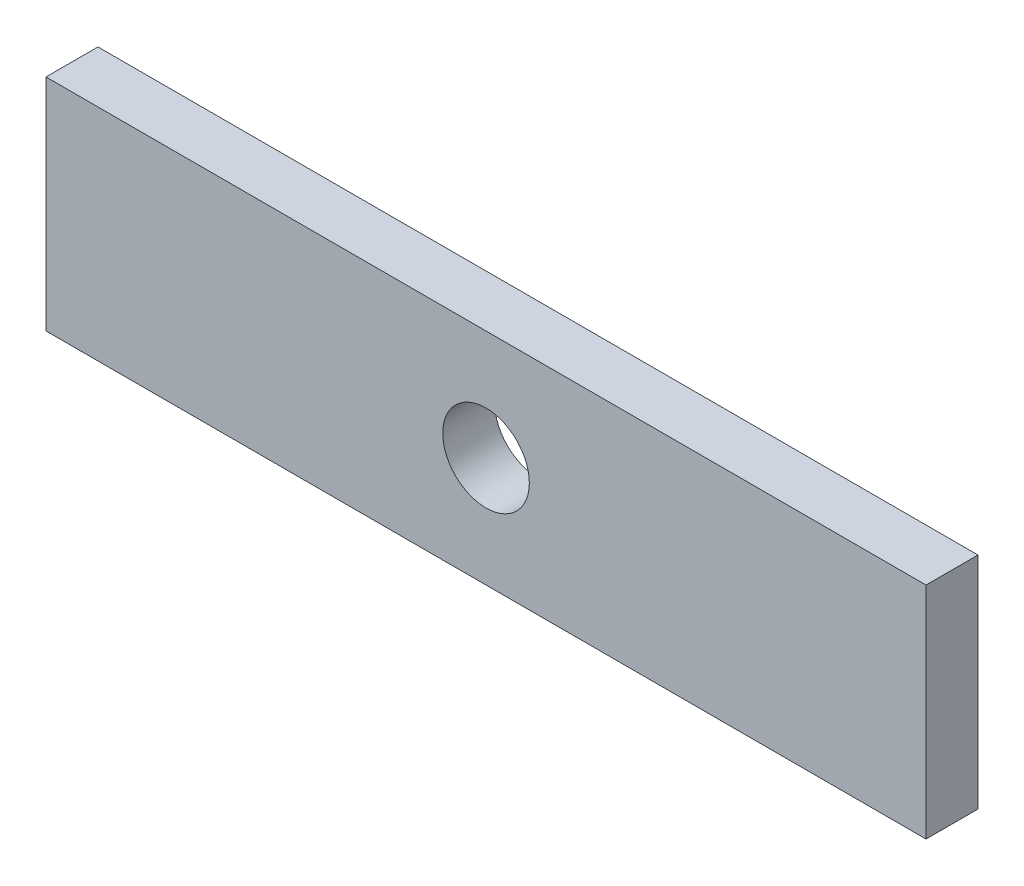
from build123d import *

# Parameters (mm, degrees)
SKETCH1_W           = 50.8
SKETCH1_H           = 12.7
SKETCH1_R           = 2.5
BOSS_EXTRUDE1_DEPTH = 3


with BuildPart() as part:
    # Sketch1 → Boss-Extrude1 (new body)
    with BuildSketch(Plane.XY):
        Rectangle(SKETCH1_W, SKETCH1_H)
        Circle(SKETCH1_R, mode=Mode.SUBTRACT)
    extrude(amount=BOSS_EXTRUDE1_DEPTH)


solid = part.part
